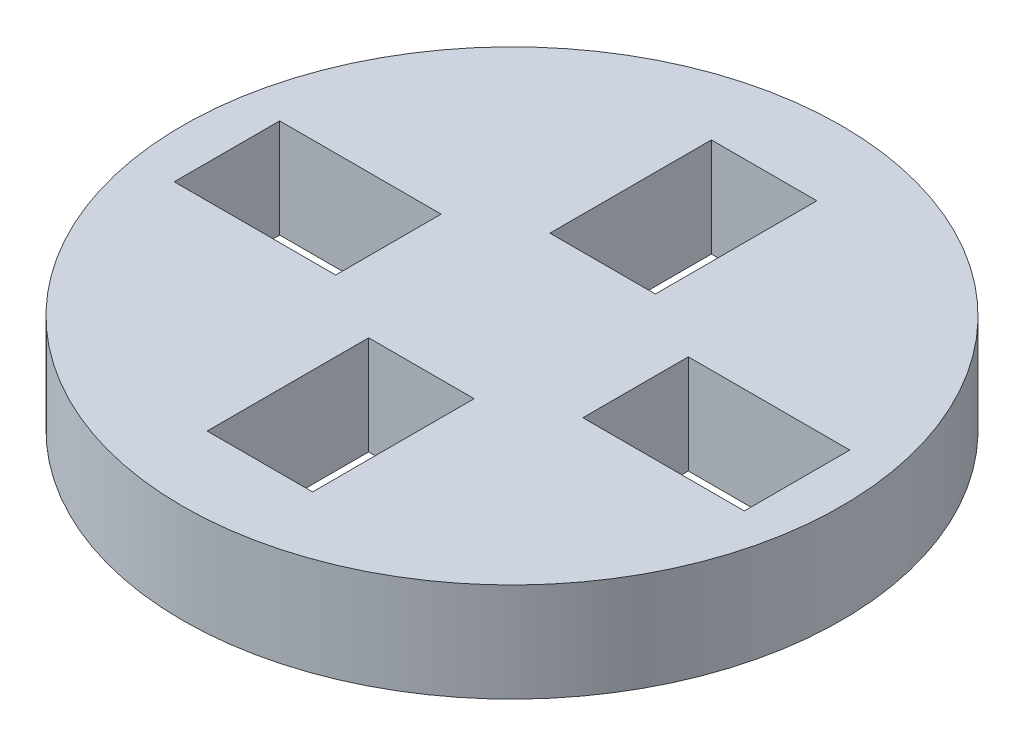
ISO-10303-21;
HEADER;
FILE_DESCRIPTION(('STEP AP214'),'2;1');
FILE_NAME('part.step','',(''),(''),'','','');
FILE_SCHEMA(('AUTOMOTIVE_DESIGN { 1 0 10303 214 1 1 1 1 }'));
ENDSEC;
DATA;
#1=APPLICATION_CONTEXT('core data for automotive mechanical design processes');
#2=APPLICATION_PROTOCOL_DEFINITION('international standard','automotive_design',2000,#1);
#3=PRODUCT_CONTEXT('',#1,'mechanical');
#4=PRODUCT('Part','Part','',(#3));
#5=PRODUCT_RELATED_PRODUCT_CATEGORY('part','',(#4));
#6=PRODUCT_DEFINITION_FORMATION('','',#4);
#7=PRODUCT_DEFINITION_CONTEXT('part definition',#1,'design');
#8=PRODUCT_DEFINITION('design','',#6,#7);
#9=PRODUCT_DEFINITION_SHAPE('','',#8);
#10=(LENGTH_UNIT() NAMED_UNIT(*) SI_UNIT(.MILLI.,.METRE.));
#11=(NAMED_UNIT(*) PLANE_ANGLE_UNIT() SI_UNIT($,.RADIAN.));
#12=(NAMED_UNIT(*) SI_UNIT($,.STERADIAN.) SOLID_ANGLE_UNIT());
#13=UNCERTAINTY_MEASURE_WITH_UNIT(LENGTH_MEASURE(1.E-05),#10,'distance_accuracy_value','');
#14=(GEOMETRIC_REPRESENTATION_CONTEXT(3) GLOBAL_UNCERTAINTY_ASSIGNED_CONTEXT((#13)) GLOBAL_UNIT_ASSIGNED_CONTEXT((#10,
#11,#12)) REPRESENTATION_CONTEXT('',''));
#15=CARTESIAN_POINT('',(0.,0.,0.));
#16=DIRECTION('',(0.,0.,1.));
#17=DIRECTION('',(1.,0.,0.));
#18=AXIS2_PLACEMENT_3D('',#15,#16,#17);
#19=CARTESIAN_POINT('',(0.,3.,0.));
#20=DIRECTION('',(0.,1.,0.));
#21=DIRECTION('',(0.,0.,1.));
#22=AXIS2_PLACEMENT_3D('',#19,#20,#21);
#23=PLANE('',#22);
#24=CARTESIAN_POINT('',(0.,3.,0.));
#25=DIRECTION('',(0.,1.,0.));
#26=DIRECTION('',(0.,0.,1.));
#27=AXIS2_PLACEMENT_3D('',#24,#25,#26);
#28=CIRCLE('',#27,10.);
#29=CARTESIAN_POINT('',(0.,3.,10.));
#30=VERTEX_POINT('',#29);
#31=EDGE_CURVE('E11',#30,#30,#28,.T.);
#32=ORIENTED_EDGE('',*,*,#31,.T.);
#33=EDGE_LOOP('',(#32));
#34=FACE_BOUND('',#33,.T.);
#35=DIRECTION('',(1.,0.,0.));
#36=VECTOR('',#35,1.);
#37=CARTESIAN_POINT('',(3.75,3.,1.6));
#38=LINE('',#37,#36);
#39=CARTESIAN_POINT('',(3.75,3.,1.6));
#40=VERTEX_POINT('',#39);
#41=CARTESIAN_POINT('',(8.65,3.,1.6));
#42=VERTEX_POINT('',#41);
#43=EDGE_CURVE('E293',#40,#42,#38,.T.);
#44=ORIENTED_EDGE('',*,*,#43,.F.);
#45=DIRECTION('',(0.,0.,1.));
#46=VECTOR('',#45,1.);
#47=CARTESIAN_POINT('',(3.75,3.,-1.6));
#48=LINE('',#47,#46);
#49=CARTESIAN_POINT('',(3.75,3.,-1.6));
#50=VERTEX_POINT('',#49);
#51=EDGE_CURVE('E290',#50,#40,#48,.T.);
#52=ORIENTED_EDGE('',*,*,#51,.F.);
#53=DIRECTION('',(-1.,0.,0.));
#54=VECTOR('',#53,1.);
#55=CARTESIAN_POINT('',(3.75,3.,-1.6));
#56=LINE('',#55,#54);
#57=CARTESIAN_POINT('',(8.65,3.,-1.6));
#58=VERTEX_POINT('',#57);
#59=EDGE_CURVE('E301',#58,#50,#56,.T.);
#60=ORIENTED_EDGE('',*,*,#59,.F.);
#61=DIRECTION('',(0.,0.,-1.));
#62=VECTOR('',#61,1.);
#63=CARTESIAN_POINT('',(8.65,3.,-1.6));
#64=LINE('',#63,#62);
#65=EDGE_CURVE('E297',#42,#58,#64,.T.);
#66=ORIENTED_EDGE('',*,*,#65,.F.);
#67=EDGE_LOOP('',(#44,#52,#60,#66));
#68=FACE_BOUND('',#67,.T.);
#69=DIRECTION('',(1.,0.,0.));
#70=VECTOR('',#69,1.);
#71=CARTESIAN_POINT('',(-1.6,3.,-2.75));
#72=LINE('',#71,#70);
#73=CARTESIAN_POINT('',(-1.6,3.,-2.75));
#74=VERTEX_POINT('',#73);
#75=CARTESIAN_POINT('',(1.6,3.,-2.75));
#76=VERTEX_POINT('',#75);
#77=EDGE_CURVE('E250',#74,#76,#72,.T.);
#78=ORIENTED_EDGE('',*,*,#77,.F.);
#79=DIRECTION('',(0.,0.,1.));
#80=VECTOR('',#79,1.);
#81=CARTESIAN_POINT('',(-1.6,3.,-7.65));
#82=LINE('',#81,#80);
#83=CARTESIAN_POINT('',(-1.6,3.,-7.65));
#84=VERTEX_POINT('',#83);
#85=EDGE_CURVE('E247',#84,#74,#82,.T.);
#86=ORIENTED_EDGE('',*,*,#85,.F.);
#87=DIRECTION('',(-1.,0.,0.));
#88=VECTOR('',#87,1.);
#89=CARTESIAN_POINT('',(-1.6,3.,-7.65));
#90=LINE('',#89,#88);
#91=CARTESIAN_POINT('',(1.6,3.,-7.65));
#92=VERTEX_POINT('',#91);
#93=EDGE_CURVE('E258',#92,#84,#90,.T.);
#94=ORIENTED_EDGE('',*,*,#93,.F.);
#95=DIRECTION('',(0.,0.,-1.));
#96=VECTOR('',#95,1.);
#97=CARTESIAN_POINT('',(1.6,3.,-7.65));
#98=LINE('',#97,#96);
#99=EDGE_CURVE('E254',#76,#92,#98,.T.);
#100=ORIENTED_EDGE('',*,*,#99,.F.);
#101=EDGE_LOOP('',(#78,#86,#94,#100));
#102=FACE_BOUND('',#101,.T.);
#103=DIRECTION('',(-1.,0.,0.));
#104=VECTOR('',#103,1.);
#105=CARTESIAN_POINT('',(-3.75,3.,-1.6));
#106=LINE('',#105,#104);
#107=CARTESIAN_POINT('',(-3.75,3.,-1.6));
#108=VERTEX_POINT('',#107);
#109=CARTESIAN_POINT('',(-8.65,3.,-1.6));
#110=VERTEX_POINT('',#109);
#111=EDGE_CURVE('E207',#108,#110,#106,.T.);
#112=ORIENTED_EDGE('',*,*,#111,.F.);
#113=DIRECTION('',(0.,0.,-1.));
#114=VECTOR('',#113,1.);
#115=CARTESIAN_POINT('',(-3.75,3.,-1.6));
#116=LINE('',#115,#114);
#117=CARTESIAN_POINT('',(-3.75,3.,1.6));
#118=VERTEX_POINT('',#117);
#119=EDGE_CURVE('E204',#118,#108,#116,.T.);
#120=ORIENTED_EDGE('',*,*,#119,.F.);
#121=DIRECTION('',(1.,0.,0.));
#122=VECTOR('',#121,1.);
#123=CARTESIAN_POINT('',(-3.75,3.,1.6));
#124=LINE('',#123,#122);
#125=CARTESIAN_POINT('',(-8.65,3.,1.6));
#126=VERTEX_POINT('',#125);
#127=EDGE_CURVE('E215',#126,#118,#124,.T.);
#128=ORIENTED_EDGE('',*,*,#127,.F.);
#129=DIRECTION('',(0.,0.,1.));
#130=VECTOR('',#129,1.);
#131=CARTESIAN_POINT('',(-8.65,3.,-1.6));
#132=LINE('',#131,#130);
#133=EDGE_CURVE('E211',#110,#126,#132,.T.);
#134=ORIENTED_EDGE('',*,*,#133,.F.);
#135=EDGE_LOOP('',(#112,#120,#128,#134));
#136=FACE_BOUND('',#135,.T.);
#137=DIRECTION('',(1.,0.,0.));
#138=VECTOR('',#137,1.);
#139=CARTESIAN_POINT('',(-1.6,3.,7.65));
#140=LINE('',#139,#138);
#141=CARTESIAN_POINT('',(-1.6,3.,7.65));
#142=VERTEX_POINT('',#141);
#143=CARTESIAN_POINT('',(1.6,3.,7.65));
#144=VERTEX_POINT('',#143);
#145=EDGE_CURVE('E165',#142,#144,#140,.T.);
#146=ORIENTED_EDGE('',*,*,#145,.F.);
#147=DIRECTION('',(0.,0.,1.));
#148=VECTOR('',#147,1.);
#149=CARTESIAN_POINT('',(-1.6,3.,2.75));
#150=LINE('',#149,#148);
#151=CARTESIAN_POINT('',(-1.6,3.,2.75));
#152=VERTEX_POINT('',#151);
#153=EDGE_CURVE('E156',#152,#142,#150,.T.);
#154=ORIENTED_EDGE('',*,*,#153,.F.);
#155=DIRECTION('',(-1.,0.,0.));
#156=VECTOR('',#155,1.);
#157=CARTESIAN_POINT('',(-1.6,3.,2.75));
#158=LINE('',#157,#156);
#159=CARTESIAN_POINT('',(1.6,3.,2.75));
#160=VERTEX_POINT('',#159);
#161=EDGE_CURVE('E182',#160,#152,#158,.T.);
#162=ORIENTED_EDGE('',*,*,#161,.F.);
#163=DIRECTION('',(0.,0.,-1.));
#164=VECTOR('',#163,1.);
#165=CARTESIAN_POINT('',(1.6,3.,2.75));
#166=LINE('',#165,#164);
#167=EDGE_CURVE('E178',#144,#160,#166,.T.);
#168=ORIENTED_EDGE('',*,*,#167,.F.);
#169=EDGE_LOOP('',(#146,#154,#162,#168));
#170=FACE_BOUND('',#169,.T.);
#171=ADVANCED_FACE('F42',(#34,#68,#102,#136,#170),#23,.T.);
#172=CARTESIAN_POINT('',(0.,0.,0.));
#173=DIRECTION('',(0.,1.,0.));
#174=DIRECTION('',(0.,0.,1.));
#175=AXIS2_PLACEMENT_3D('',#172,#173,#174);
#176=PLANE('',#175);
#177=DIRECTION('',(0.,0.,-1.));
#178=VECTOR('',#177,1.);
#179=CARTESIAN_POINT('',(-3.75,0.,-1.6));
#180=LINE('',#179,#178);
#181=CARTESIAN_POINT('',(-3.75,0.,1.6));
#182=VERTEX_POINT('',#181);
#183=CARTESIAN_POINT('',(-3.75,0.,-1.6));
#184=VERTEX_POINT('',#183);
#185=EDGE_CURVE('E174',#182,#184,#180,.T.);
#186=ORIENTED_EDGE('',*,*,#185,.T.);
#187=DIRECTION('',(-1.,0.,0.));
#188=VECTOR('',#187,1.);
#189=CARTESIAN_POINT('',(-3.75,0.,-1.6));
#190=LINE('',#189,#188);
#191=CARTESIAN_POINT('',(-8.65,0.,-1.6));
#192=VERTEX_POINT('',#191);
#193=EDGE_CURVE('E222',#184,#192,#190,.T.);
#194=ORIENTED_EDGE('',*,*,#193,.T.);
#195=DIRECTION('',(0.,0.,1.));
#196=VECTOR('',#195,1.);
#197=CARTESIAN_POINT('',(-8.65,0.,-1.6));
#198=LINE('',#197,#196);
#199=CARTESIAN_POINT('',(-8.65,0.,1.6));
#200=VERTEX_POINT('',#199);
#201=EDGE_CURVE('E226',#192,#200,#198,.T.);
#202=ORIENTED_EDGE('',*,*,#201,.T.);
#203=DIRECTION('',(1.,0.,0.));
#204=VECTOR('',#203,1.);
#205=CARTESIAN_POINT('',(-3.75,0.,1.6));
#206=LINE('',#205,#204);
#207=EDGE_CURVE('E208',#200,#182,#206,.T.);
#208=ORIENTED_EDGE('',*,*,#207,.T.);
#209=EDGE_LOOP('',(#186,#194,#202,#208));
#210=FACE_BOUND('',#209,.T.);
#211=DIRECTION('',(0.,0.,1.));
#212=VECTOR('',#211,1.);
#213=CARTESIAN_POINT('',(3.75,0.,-1.6));
#214=LINE('',#213,#212);
#215=CARTESIAN_POINT('',(3.75,0.,-1.6));
#216=VERTEX_POINT('',#215);
#217=CARTESIAN_POINT('',(3.75,0.,1.6));
#218=VERTEX_POINT('',#217);
#219=EDGE_CURVE('E289',#216,#218,#214,.T.);
#220=ORIENTED_EDGE('',*,*,#219,.T.);
#221=DIRECTION('',(1.,0.,0.));
#222=VECTOR('',#221,1.);
#223=CARTESIAN_POINT('',(3.75,0.,1.6));
#224=LINE('',#223,#222);
#225=CARTESIAN_POINT('',(8.65,0.,1.6));
#226=VERTEX_POINT('',#225);
#227=EDGE_CURVE('E308',#218,#226,#224,.T.);
#228=ORIENTED_EDGE('',*,*,#227,.T.);
#229=DIRECTION('',(0.,0.,-1.));
#230=VECTOR('',#229,1.);
#231=CARTESIAN_POINT('',(8.65,0.,-1.6));
#232=LINE('',#231,#230);
#233=CARTESIAN_POINT('',(8.65,0.,-1.6));
#234=VERTEX_POINT('',#233);
#235=EDGE_CURVE('E312',#226,#234,#232,.T.);
#236=ORIENTED_EDGE('',*,*,#235,.T.);
#237=DIRECTION('',(-1.,0.,0.));
#238=VECTOR('',#237,1.);
#239=CARTESIAN_POINT('',(3.75,0.,-1.6));
#240=LINE('',#239,#238);
#241=EDGE_CURVE('E294',#234,#216,#240,.T.);
#242=ORIENTED_EDGE('',*,*,#241,.T.);
#243=EDGE_LOOP('',(#220,#228,#236,#242));
#244=FACE_BOUND('',#243,.T.);
#245=CARTESIAN_POINT('',(0.,0.,0.));
#246=DIRECTION('',(0.,1.,0.));
#247=DIRECTION('',(0.,0.,1.));
#248=AXIS2_PLACEMENT_3D('',#245,#246,#247);
#249=CIRCLE('',#248,10.);
#250=CARTESIAN_POINT('',(0.,0.,10.));
#251=VERTEX_POINT('',#250);
#252=EDGE_CURVE('E46',#251,#251,#249,.T.);
#253=ORIENTED_EDGE('',*,*,#252,.F.);
#254=EDGE_LOOP('',(#253));
#255=FACE_BOUND('',#254,.T.);
#256=DIRECTION('',(0.,0.,1.));
#257=VECTOR('',#256,1.);
#258=CARTESIAN_POINT('',(-1.6,0.,-7.65));
#259=LINE('',#258,#257);
#260=CARTESIAN_POINT('',(-1.6,0.,-7.65));
#261=VERTEX_POINT('',#260);
#262=CARTESIAN_POINT('',(-1.6,0.,-2.75));
#263=VERTEX_POINT('',#262);
#264=EDGE_CURVE('E246',#261,#263,#259,.T.);
#265=ORIENTED_EDGE('',*,*,#264,.T.);
#266=DIRECTION('',(1.,0.,0.));
#267=VECTOR('',#266,1.);
#268=CARTESIAN_POINT('',(-1.6,0.,-2.75));
#269=LINE('',#268,#267);
#270=CARTESIAN_POINT('',(1.6,0.,-2.75));
#271=VERTEX_POINT('',#270);
#272=EDGE_CURVE('E265',#263,#271,#269,.T.);
#273=ORIENTED_EDGE('',*,*,#272,.T.);
#274=DIRECTION('',(0.,0.,-1.));
#275=VECTOR('',#274,1.);
#276=CARTESIAN_POINT('',(1.6,0.,-7.65));
#277=LINE('',#276,#275);
#278=CARTESIAN_POINT('',(1.6,0.,-7.65));
#279=VERTEX_POINT('',#278);
#280=EDGE_CURVE('E269',#271,#279,#277,.T.);
#281=ORIENTED_EDGE('',*,*,#280,.T.);
#282=DIRECTION('',(-1.,0.,0.));
#283=VECTOR('',#282,1.);
#284=CARTESIAN_POINT('',(-1.6,0.,-7.65));
#285=LINE('',#284,#283);
#286=EDGE_CURVE('E251',#279,#261,#285,.T.);
#287=ORIENTED_EDGE('',*,*,#286,.T.);
#288=EDGE_LOOP('',(#265,#273,#281,#287));
#289=FACE_BOUND('',#288,.T.);
#290=DIRECTION('',(0.,0.,1.));
#291=VECTOR('',#290,1.);
#292=CARTESIAN_POINT('',(-1.6,0.,2.75));
#293=LINE('',#292,#291);
#294=CARTESIAN_POINT('',(-1.6,0.,2.75));
#295=VERTEX_POINT('',#294);
#296=CARTESIAN_POINT('',(-1.6,0.,7.65));
#297=VERTEX_POINT('',#296);
#298=EDGE_CURVE('E66',#295,#297,#293,.T.);
#299=ORIENTED_EDGE('',*,*,#298,.T.);
#300=DIRECTION('',(1.,0.,0.));
#301=VECTOR('',#300,1.);
#302=CARTESIAN_POINT('',(-1.6,0.,7.65));
#303=LINE('',#302,#301);
#304=CARTESIAN_POINT('',(1.6,0.,7.65));
#305=VERTEX_POINT('',#304);
#306=EDGE_CURVE('E172',#297,#305,#303,.T.);
#307=ORIENTED_EDGE('',*,*,#306,.T.);
#308=DIRECTION('',(0.,0.,-1.));
#309=VECTOR('',#308,1.);
#310=CARTESIAN_POINT('',(1.6,0.,2.75));
#311=LINE('',#310,#309);
#312=CARTESIAN_POINT('',(1.6,0.,2.75));
#313=VERTEX_POINT('',#312);
#314=EDGE_CURVE('E191',#305,#313,#311,.T.);
#315=ORIENTED_EDGE('',*,*,#314,.T.);
#316=DIRECTION('',(-1.,0.,0.));
#317=VECTOR('',#316,1.);
#318=CARTESIAN_POINT('',(-1.6,0.,2.75));
#319=LINE('',#318,#317);
#320=EDGE_CURVE('E166',#313,#295,#319,.T.);
#321=ORIENTED_EDGE('',*,*,#320,.T.);
#322=EDGE_LOOP('',(#299,#307,#315,#321));
#323=FACE_BOUND('',#322,.T.);
#324=ADVANCED_FACE('F338',(#210,#244,#255,#289,#323),#176,.F.);
#325=CARTESIAN_POINT('',(0.,3.,0.));
#326=DIRECTION('',(0.,-1.,0.));
#327=DIRECTION('',(0.,0.,-1.));
#328=AXIS2_PLACEMENT_3D('',#325,#326,#327);
#329=CYLINDRICAL_SURFACE('',#328,10.);
#330=ORIENTED_EDGE('',*,*,#31,.F.);
#331=EDGE_LOOP('',(#330));
#332=FACE_BOUND('',#331,.T.);
#333=ORIENTED_EDGE('',*,*,#252,.T.);
#334=EDGE_LOOP('',(#333));
#335=FACE_BOUND('',#334,.T.);
#336=ADVANCED_FACE('F44',(#332,#335),#329,.T.);
#337=CARTESIAN_POINT('',(3.75,3.,-1.6));
#338=DIRECTION('',(1.,0.,0.));
#339=DIRECTION('',(0.,0.,-1.));
#340=AXIS2_PLACEMENT_3D('',#337,#338,#339);
#341=PLANE('',#340);
#342=ORIENTED_EDGE('',*,*,#219,.F.);
#343=DIRECTION('',(0.,-1.,0.));
#344=VECTOR('',#343,1.);
#345=CARTESIAN_POINT('',(3.75,3.,-1.6));
#346=LINE('',#345,#344);
#347=EDGE_CURVE('E304',#50,#216,#346,.T.);
#348=ORIENTED_EDGE('',*,*,#347,.F.);
#349=ORIENTED_EDGE('',*,*,#51,.T.);
#350=DIRECTION('',(0.,-1.,0.));
#351=VECTOR('',#350,1.);
#352=CARTESIAN_POINT('',(3.75,3.,1.6));
#353=LINE('',#352,#351);
#354=EDGE_CURVE('E328',#40,#218,#353,.T.);
#355=ORIENTED_EDGE('',*,*,#354,.T.);
#356=EDGE_LOOP('',(#342,#348,#349,#355));
#357=FACE_BOUND('',#356,.T.);
#358=ADVANCED_FACE('F360',(#357),#341,.T.);
#359=CARTESIAN_POINT('',(3.75,3.,1.6));
#360=DIRECTION('',(0.,0.,-1.));
#361=DIRECTION('',(-1.,0.,0.));
#362=AXIS2_PLACEMENT_3D('',#359,#360,#361);
#363=PLANE('',#362);
#364=ORIENTED_EDGE('',*,*,#227,.F.);
#365=ORIENTED_EDGE('',*,*,#354,.F.);
#366=ORIENTED_EDGE('',*,*,#43,.T.);
#367=DIRECTION('',(0.,-1.,0.));
#368=VECTOR('',#367,1.);
#369=CARTESIAN_POINT('',(8.65,3.,1.6));
#370=LINE('',#369,#368);
#371=EDGE_CURVE('E325',#42,#226,#370,.T.);
#372=ORIENTED_EDGE('',*,*,#371,.T.);
#373=EDGE_LOOP('',(#364,#365,#366,#372));
#374=FACE_BOUND('',#373,.T.);
#375=ADVANCED_FACE('F363',(#374),#363,.T.);
#376=CARTESIAN_POINT('',(8.65,3.,-1.6));
#377=DIRECTION('',(-1.,0.,0.));
#378=DIRECTION('',(0.,0.,1.));
#379=AXIS2_PLACEMENT_3D('',#376,#377,#378);
#380=PLANE('',#379);
#381=ORIENTED_EDGE('',*,*,#235,.F.);
#382=ORIENTED_EDGE('',*,*,#371,.F.);
#383=ORIENTED_EDGE('',*,*,#65,.T.);
#384=DIRECTION('',(0.,-1.,0.));
#385=VECTOR('',#384,1.);
#386=CARTESIAN_POINT('',(8.65,3.,-1.6));
#387=LINE('',#386,#385);
#388=EDGE_CURVE('E322',#58,#234,#387,.T.);
#389=ORIENTED_EDGE('',*,*,#388,.T.);
#390=EDGE_LOOP('',(#381,#382,#383,#389));
#391=FACE_BOUND('',#390,.T.);
#392=ADVANCED_FACE('F366',(#391),#380,.T.);
#393=CARTESIAN_POINT('',(3.75,3.,-1.6));
#394=DIRECTION('',(0.,0.,1.));
#395=DIRECTION('',(1.,0.,0.));
#396=AXIS2_PLACEMENT_3D('',#393,#394,#395);
#397=PLANE('',#396);
#398=ORIENTED_EDGE('',*,*,#241,.F.);
#399=ORIENTED_EDGE('',*,*,#388,.F.);
#400=ORIENTED_EDGE('',*,*,#59,.T.);
#401=ORIENTED_EDGE('',*,*,#347,.T.);
#402=EDGE_LOOP('',(#398,#399,#400,#401));
#403=FACE_BOUND('',#402,.T.);
#404=ADVANCED_FACE('F370',(#403),#397,.T.);
#405=CARTESIAN_POINT('',(-1.6,3.,-7.65));
#406=DIRECTION('',(1.,0.,0.));
#407=DIRECTION('',(0.,0.,-1.));
#408=AXIS2_PLACEMENT_3D('',#405,#406,#407);
#409=PLANE('',#408);
#410=ORIENTED_EDGE('',*,*,#264,.F.);
#411=DIRECTION('',(0.,-1.,0.));
#412=VECTOR('',#411,1.);
#413=CARTESIAN_POINT('',(-1.6,3.,-7.65));
#414=LINE('',#413,#412);
#415=EDGE_CURVE('E261',#84,#261,#414,.T.);
#416=ORIENTED_EDGE('',*,*,#415,.F.);
#417=ORIENTED_EDGE('',*,*,#85,.T.);
#418=DIRECTION('',(0.,-1.,0.));
#419=VECTOR('',#418,1.);
#420=CARTESIAN_POINT('',(-1.6,3.,-2.75));
#421=LINE('',#420,#419);
#422=EDGE_CURVE('E285',#74,#263,#421,.T.);
#423=ORIENTED_EDGE('',*,*,#422,.T.);
#424=EDGE_LOOP('',(#410,#416,#417,#423));
#425=FACE_BOUND('',#424,.T.);
#426=ADVANCED_FACE('F374',(#425),#409,.T.);
#427=CARTESIAN_POINT('',(-1.6,3.,-2.75));
#428=DIRECTION('',(0.,0.,-1.));
#429=DIRECTION('',(-1.,0.,0.));
#430=AXIS2_PLACEMENT_3D('',#427,#428,#429);
#431=PLANE('',#430);
#432=ORIENTED_EDGE('',*,*,#272,.F.);
#433=ORIENTED_EDGE('',*,*,#422,.F.);
#434=ORIENTED_EDGE('',*,*,#77,.T.);
#435=DIRECTION('',(0.,-1.,0.));
#436=VECTOR('',#435,1.);
#437=CARTESIAN_POINT('',(1.6,3.,-2.75));
#438=LINE('',#437,#436);
#439=EDGE_CURVE('E282',#76,#271,#438,.T.);
#440=ORIENTED_EDGE('',*,*,#439,.T.);
#441=EDGE_LOOP('',(#432,#433,#434,#440));
#442=FACE_BOUND('',#441,.T.);
#443=ADVANCED_FACE('F378',(#442),#431,.T.);
#444=CARTESIAN_POINT('',(1.6,3.,-7.65));
#445=DIRECTION('',(-1.,0.,0.));
#446=DIRECTION('',(0.,0.,1.));
#447=AXIS2_PLACEMENT_3D('',#444,#445,#446);
#448=PLANE('',#447);
#449=ORIENTED_EDGE('',*,*,#280,.F.);
#450=ORIENTED_EDGE('',*,*,#439,.F.);
#451=ORIENTED_EDGE('',*,*,#99,.T.);
#452=DIRECTION('',(0.,-1.,0.));
#453=VECTOR('',#452,1.);
#454=CARTESIAN_POINT('',(1.6,3.,-7.65));
#455=LINE('',#454,#453);
#456=EDGE_CURVE('E279',#92,#279,#455,.T.);
#457=ORIENTED_EDGE('',*,*,#456,.T.);
#458=EDGE_LOOP('',(#449,#450,#451,#457));
#459=FACE_BOUND('',#458,.T.);
#460=ADVANCED_FACE('F382',(#459),#448,.T.);
#461=CARTESIAN_POINT('',(-1.6,3.,-7.65));
#462=DIRECTION('',(0.,0.,1.));
#463=DIRECTION('',(1.,0.,0.));
#464=AXIS2_PLACEMENT_3D('',#461,#462,#463);
#465=PLANE('',#464);
#466=ORIENTED_EDGE('',*,*,#286,.F.);
#467=ORIENTED_EDGE('',*,*,#456,.F.);
#468=ORIENTED_EDGE('',*,*,#93,.T.);
#469=ORIENTED_EDGE('',*,*,#415,.T.);
#470=EDGE_LOOP('',(#466,#467,#468,#469));
#471=FACE_BOUND('',#470,.T.);
#472=ADVANCED_FACE('F386',(#471),#465,.T.);
#473=CARTESIAN_POINT('',(-3.75,3.,-1.6));
#474=DIRECTION('',(-1.,0.,0.));
#475=DIRECTION('',(0.,0.,1.));
#476=AXIS2_PLACEMENT_3D('',#473,#474,#475);
#477=PLANE('',#476);
#478=ORIENTED_EDGE('',*,*,#185,.F.);
#479=DIRECTION('',(0.,-1.,0.));
#480=VECTOR('',#479,1.);
#481=CARTESIAN_POINT('',(-3.75,3.,1.6));
#482=LINE('',#481,#480);
#483=EDGE_CURVE('E218',#118,#182,#482,.T.);
#484=ORIENTED_EDGE('',*,*,#483,.F.);
#485=ORIENTED_EDGE('',*,*,#119,.T.);
#486=DIRECTION('',(0.,-1.,0.));
#487=VECTOR('',#486,1.);
#488=CARTESIAN_POINT('',(-3.75,3.,-1.6));
#489=LINE('',#488,#487);
#490=EDGE_CURVE('E242',#108,#184,#489,.T.);
#491=ORIENTED_EDGE('',*,*,#490,.T.);
#492=EDGE_LOOP('',(#478,#484,#485,#491));
#493=FACE_BOUND('',#492,.T.);
#494=ADVANCED_FACE('F390',(#493),#477,.T.);
#495=CARTESIAN_POINT('',(-3.75,3.,-1.6));
#496=DIRECTION('',(0.,0.,1.));
#497=DIRECTION('',(1.,0.,0.));
#498=AXIS2_PLACEMENT_3D('',#495,#496,#497);
#499=PLANE('',#498);
#500=ORIENTED_EDGE('',*,*,#193,.F.);
#501=ORIENTED_EDGE('',*,*,#490,.F.);
#502=ORIENTED_EDGE('',*,*,#111,.T.);
#503=DIRECTION('',(0.,-1.,0.));
#504=VECTOR('',#503,1.);
#505=CARTESIAN_POINT('',(-8.65,3.,-1.6));
#506=LINE('',#505,#504);
#507=EDGE_CURVE('E239',#110,#192,#506,.T.);
#508=ORIENTED_EDGE('',*,*,#507,.T.);
#509=EDGE_LOOP('',(#500,#501,#502,#508));
#510=FACE_BOUND('',#509,.T.);
#511=ADVANCED_FACE('F394',(#510),#499,.T.);
#512=CARTESIAN_POINT('',(-8.65,3.,-1.6));
#513=DIRECTION('',(1.,0.,0.));
#514=DIRECTION('',(0.,0.,-1.));
#515=AXIS2_PLACEMENT_3D('',#512,#513,#514);
#516=PLANE('',#515);
#517=ORIENTED_EDGE('',*,*,#201,.F.);
#518=ORIENTED_EDGE('',*,*,#507,.F.);
#519=ORIENTED_EDGE('',*,*,#133,.T.);
#520=DIRECTION('',(0.,-1.,0.));
#521=VECTOR('',#520,1.);
#522=CARTESIAN_POINT('',(-8.65,3.,1.6));
#523=LINE('',#522,#521);
#524=EDGE_CURVE('E236',#126,#200,#523,.T.);
#525=ORIENTED_EDGE('',*,*,#524,.T.);
#526=EDGE_LOOP('',(#517,#518,#519,#525));
#527=FACE_BOUND('',#526,.T.);
#528=ADVANCED_FACE('F398',(#527),#516,.T.);
#529=CARTESIAN_POINT('',(-3.75,3.,1.6));
#530=DIRECTION('',(0.,0.,-1.));
#531=DIRECTION('',(-1.,0.,0.));
#532=AXIS2_PLACEMENT_3D('',#529,#530,#531);
#533=PLANE('',#532);
#534=ORIENTED_EDGE('',*,*,#207,.F.);
#535=ORIENTED_EDGE('',*,*,#524,.F.);
#536=ORIENTED_EDGE('',*,*,#127,.T.);
#537=ORIENTED_EDGE('',*,*,#483,.T.);
#538=EDGE_LOOP('',(#534,#535,#536,#537));
#539=FACE_BOUND('',#538,.T.);
#540=ADVANCED_FACE('F402',(#539),#533,.T.);
#541=CARTESIAN_POINT('',(-1.6,3.,2.75));
#542=DIRECTION('',(1.,0.,0.));
#543=DIRECTION('',(0.,0.,-1.));
#544=AXIS2_PLACEMENT_3D('',#541,#542,#543);
#545=PLANE('',#544);
#546=ORIENTED_EDGE('',*,*,#298,.F.);
#547=DIRECTION('',(0.,-1.,0.));
#548=VECTOR('',#547,1.);
#549=CARTESIAN_POINT('',(-1.6,3.,2.75));
#550=LINE('',#549,#548);
#551=EDGE_CURVE('E160',#152,#295,#550,.T.);
#552=ORIENTED_EDGE('',*,*,#551,.F.);
#553=ORIENTED_EDGE('',*,*,#153,.T.);
#554=DIRECTION('',(0.,-1.,0.));
#555=VECTOR('',#554,1.);
#556=CARTESIAN_POINT('',(-1.6,3.,7.65));
#557=LINE('',#556,#555);
#558=EDGE_CURVE('E159',#142,#297,#557,.T.);
#559=ORIENTED_EDGE('',*,*,#558,.T.);
#560=EDGE_LOOP('',(#546,#552,#553,#559));
#561=FACE_BOUND('',#560,.T.);
#562=ADVANCED_FACE('F158',(#561),#545,.T.);
#563=CARTESIAN_POINT('',(-1.6,3.,7.65));
#564=DIRECTION('',(0.,0.,-1.));
#565=DIRECTION('',(-1.,0.,0.));
#566=AXIS2_PLACEMENT_3D('',#563,#564,#565);
#567=PLANE('',#566);
#568=ORIENTED_EDGE('',*,*,#306,.F.);
#569=ORIENTED_EDGE('',*,*,#558,.F.);
#570=ORIENTED_EDGE('',*,*,#145,.T.);
#571=DIRECTION('',(0.,-1.,0.));
#572=VECTOR('',#571,1.);
#573=CARTESIAN_POINT('',(1.6,3.,7.65));
#574=LINE('',#573,#572);
#575=EDGE_CURVE('E175',#144,#305,#574,.T.);
#576=ORIENTED_EDGE('',*,*,#575,.T.);
#577=EDGE_LOOP('',(#568,#569,#570,#576));
#578=FACE_BOUND('',#577,.T.);
#579=ADVANCED_FACE('F169',(#578),#567,.T.);
#580=CARTESIAN_POINT('',(1.6,3.,2.75));
#581=DIRECTION('',(-1.,0.,0.));
#582=DIRECTION('',(0.,0.,1.));
#583=AXIS2_PLACEMENT_3D('',#580,#581,#582);
#584=PLANE('',#583);
#585=ORIENTED_EDGE('',*,*,#314,.F.);
#586=ORIENTED_EDGE('',*,*,#575,.F.);
#587=ORIENTED_EDGE('',*,*,#167,.T.);
#588=DIRECTION('',(0.,-1.,0.));
#589=VECTOR('',#588,1.);
#590=CARTESIAN_POINT('',(1.6,3.,2.75));
#591=LINE('',#590,#589);
#592=EDGE_CURVE('E58',#160,#313,#591,.T.);
#593=ORIENTED_EDGE('',*,*,#592,.T.);
#594=EDGE_LOOP('',(#585,#586,#587,#593));
#595=FACE_BOUND('',#594,.T.);
#596=ADVANCED_FACE('F346',(#595),#584,.T.);
#597=CARTESIAN_POINT('',(-1.6,3.,2.75));
#598=DIRECTION('',(0.,0.,1.));
#599=DIRECTION('',(1.,0.,0.));
#600=AXIS2_PLACEMENT_3D('',#597,#598,#599);
#601=PLANE('',#600);
#602=ORIENTED_EDGE('',*,*,#320,.F.);
#603=ORIENTED_EDGE('',*,*,#592,.F.);
#604=ORIENTED_EDGE('',*,*,#161,.T.);
#605=ORIENTED_EDGE('',*,*,#551,.T.);
#606=EDGE_LOOP('',(#602,#603,#604,#605));
#607=FACE_BOUND('',#606,.T.);
#608=ADVANCED_FACE('F344',(#607),#601,.T.);
#609=CLOSED_SHELL('',(#171,#324,#336,#358,#375,#392,#404,#426,#443,#460,#472,#494,#511,#528,
#540,#562,#579,#596,#608));
#610=MANIFOLD_SOLID_BREP('B2',#609);
#611=ADVANCED_BREP_SHAPE_REPRESENTATION('',(#18,#610),#14);
#612=SHAPE_DEFINITION_REPRESENTATION(#9,#611);
ENDSEC;
END-ISO-10303-21;
